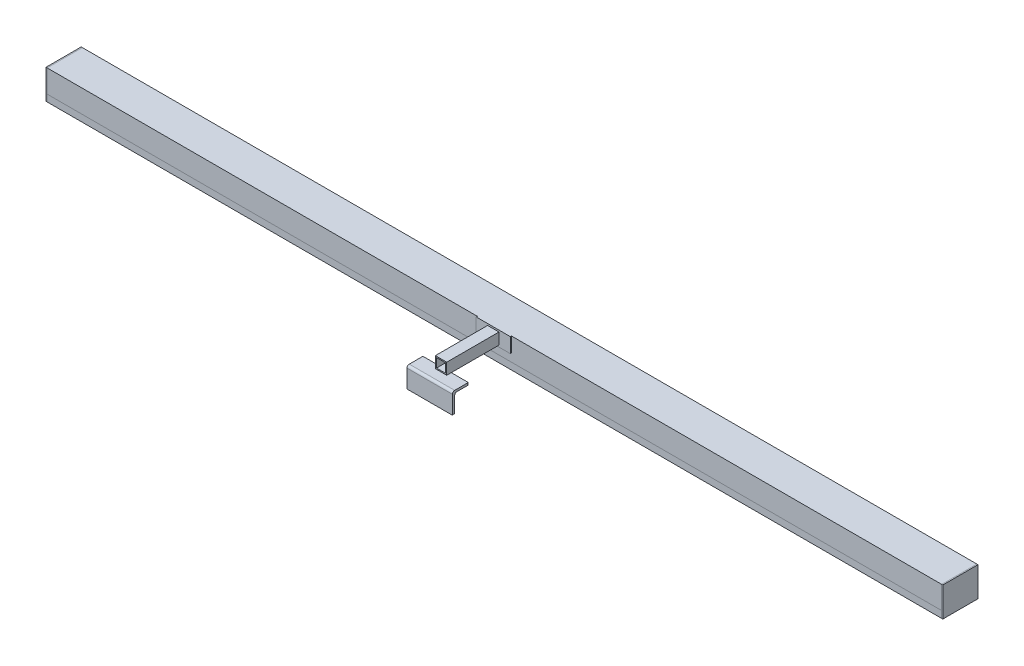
ISO-10303-21;
HEADER;
FILE_DESCRIPTION(('STEP AP214'),'2;1');
FILE_NAME('part.step','',(''),(''),'','','');
FILE_SCHEMA(('AUTOMOTIVE_DESIGN { 1 0 10303 214 1 1 1 1 }'));
ENDSEC;
DATA;
#1=APPLICATION_CONTEXT('core data for automotive mechanical design processes');
#2=APPLICATION_PROTOCOL_DEFINITION('international standard','automotive_design',2000,#1);
#3=PRODUCT_CONTEXT('',#1,'mechanical');
#4=PRODUCT('Part','Part','',(#3));
#5=PRODUCT_RELATED_PRODUCT_CATEGORY('part','',(#4));
#6=PRODUCT_DEFINITION_FORMATION('','',#4);
#7=PRODUCT_DEFINITION_CONTEXT('part definition',#1,'design');
#8=PRODUCT_DEFINITION('design','',#6,#7);
#9=PRODUCT_DEFINITION_SHAPE('','',#8);
#10=(LENGTH_UNIT() NAMED_UNIT(*) SI_UNIT(.MILLI.,.METRE.));
#11=(NAMED_UNIT(*) PLANE_ANGLE_UNIT() SI_UNIT($,.RADIAN.));
#12=(NAMED_UNIT(*) SI_UNIT($,.STERADIAN.) SOLID_ANGLE_UNIT());
#13=UNCERTAINTY_MEASURE_WITH_UNIT(LENGTH_MEASURE(1.E-05),#10,'distance_accuracy_value','');
#14=(GEOMETRIC_REPRESENTATION_CONTEXT(3) GLOBAL_UNCERTAINTY_ASSIGNED_CONTEXT((#13)) GLOBAL_UNIT_ASSIGNED_CONTEXT((#10,
#11,#12)) REPRESENTATION_CONTEXT('',''));
#15=CARTESIAN_POINT('',(0.,0.,0.));
#16=DIRECTION('',(0.,0.,1.));
#17=DIRECTION('',(1.,0.,0.));
#18=AXIS2_PLACEMENT_3D('',#15,#16,#17);
#19=CARTESIAN_POINT('',(395.,20.5,-55.));
#20=DIRECTION('',(0.,0.,-1.));
#21=DIRECTION('',(-1.,0.,0.));
#22=AXIS2_PLACEMENT_3D('',#19,#20,#21);
#23=PLANE('',#22);
#24=DIRECTION('',(0.,-1.,0.));
#25=VECTOR('',#24,1.);
#26=CARTESIAN_POINT('',(394.,20.5,-55.));
#27=LINE('',#26,#25);
#28=CARTESIAN_POINT('',(394.,20.5,-55.));
#29=VERTEX_POINT('',#28);
#30=CARTESIAN_POINT('',(394.,-5.50000000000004,-55.));
#31=VERTEX_POINT('',#30);
#32=EDGE_CURVE('E117',#29,#31,#27,.T.);
#33=ORIENTED_EDGE('',*,*,#32,.T.);
#34=DIRECTION('',(-1.,0.,0.));
#35=VECTOR('',#34,1.);
#36=CARTESIAN_POINT('',(395.,-5.50000000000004,-55.));
#37=LINE('',#36,#35);
#38=CARTESIAN_POINT('',(395.,-5.50000000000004,-55.));
#39=VERTEX_POINT('',#38);
#40=EDGE_CURVE('E12',#39,#31,#37,.T.);
#41=ORIENTED_EDGE('',*,*,#40,.F.);
#42=DIRECTION('',(0.,-1.,0.));
#43=VECTOR('',#42,1.);
#44=CARTESIAN_POINT('',(395.,20.5,-55.));
#45=LINE('',#44,#43);
#46=CARTESIAN_POINT('',(395.,20.5,-55.));
#47=VERTEX_POINT('',#46);
#48=EDGE_CURVE('E105',#47,#39,#45,.T.);
#49=ORIENTED_EDGE('',*,*,#48,.F.);
#50=DIRECTION('',(-1.,0.,0.));
#51=VECTOR('',#50,1.);
#52=CARTESIAN_POINT('',(395.,20.5,-55.));
#53=LINE('',#52,#51);
#54=EDGE_CURVE('E113',#47,#29,#53,.T.);
#55=ORIENTED_EDGE('',*,*,#54,.T.);
#56=EDGE_LOOP('',(#33,#41,#49,#55));
#57=FACE_BOUND('',#56,.T.);
#58=ADVANCED_FACE('F54',(#57),#23,.F.);
#59=CARTESIAN_POINT('',(395.,-5.50000000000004,-55.));
#60=DIRECTION('',(0.,1.,0.));
#61=DIRECTION('',(0.,0.,1.));
#62=AXIS2_PLACEMENT_3D('',#59,#60,#61);
#63=PLANE('',#62);
#64=DIRECTION('',(0.,0.,-1.));
#65=VECTOR('',#64,1.);
#66=CARTESIAN_POINT('',(394.,-5.50000000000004,-55.));
#67=LINE('',#66,#65);
#68=CARTESIAN_POINT('',(394.,-5.50000000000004,-86.));
#69=VERTEX_POINT('',#68);
#70=EDGE_CURVE('E109',#31,#69,#67,.T.);
#71=ORIENTED_EDGE('',*,*,#70,.T.);
#72=DIRECTION('',(-1.,0.,0.));
#73=VECTOR('',#72,1.);
#74=CARTESIAN_POINT('',(395.,-5.50000000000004,-86.));
#75=LINE('',#74,#73);
#76=CARTESIAN_POINT('',(395.,-5.50000000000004,-86.));
#77=VERTEX_POINT('',#76);
#78=EDGE_CURVE('E62',#77,#69,#75,.T.);
#79=ORIENTED_EDGE('',*,*,#78,.F.);
#80=DIRECTION('',(0.,0.,-1.));
#81=VECTOR('',#80,1.);
#82=CARTESIAN_POINT('',(395.,-5.50000000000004,-55.));
#83=LINE('',#82,#81);
#84=EDGE_CURVE('E100',#39,#77,#83,.T.);
#85=ORIENTED_EDGE('',*,*,#84,.F.);
#86=ORIENTED_EDGE('',*,*,#40,.T.);
#87=EDGE_LOOP('',(#71,#79,#85,#86));
#88=FACE_BOUND('',#87,.T.);
#89=ADVANCED_FACE('F108',(#88),#63,.F.);
#90=CARTESIAN_POINT('',(395.,20.5,-86.));
#91=DIRECTION('',(0.,0.,1.));
#92=DIRECTION('',(1.,0.,0.));
#93=AXIS2_PLACEMENT_3D('',#90,#91,#92);
#94=PLANE('',#93);
#95=DIRECTION('',(0.,1.,0.));
#96=VECTOR('',#95,1.);
#97=CARTESIAN_POINT('',(394.,20.5,-86.));
#98=LINE('',#97,#96);
#99=CARTESIAN_POINT('',(394.,20.5,-86.));
#100=VERTEX_POINT('',#99);
#101=EDGE_CURVE('E87',#69,#100,#98,.T.);
#102=ORIENTED_EDGE('',*,*,#101,.T.);
#103=DIRECTION('',(-1.,0.,0.));
#104=VECTOR('',#103,1.);
#105=CARTESIAN_POINT('',(395.,20.5,-86.));
#106=LINE('',#105,#104);
#107=CARTESIAN_POINT('',(395.,20.5,-86.));
#108=VERTEX_POINT('',#107);
#109=EDGE_CURVE('E110',#108,#100,#106,.T.);
#110=ORIENTED_EDGE('',*,*,#109,.F.);
#111=DIRECTION('',(0.,1.,0.));
#112=VECTOR('',#111,1.);
#113=CARTESIAN_POINT('',(395.,20.5,-86.));
#114=LINE('',#113,#112);
#115=EDGE_CURVE('E103',#77,#108,#114,.T.);
#116=ORIENTED_EDGE('',*,*,#115,.F.);
#117=ORIENTED_EDGE('',*,*,#78,.T.);
#118=EDGE_LOOP('',(#102,#110,#116,#117));
#119=FACE_BOUND('',#118,.T.);
#120=ADVANCED_FACE('F111',(#119),#94,.F.);
#121=CARTESIAN_POINT('',(395.,20.5,-55.));
#122=DIRECTION('',(0.,-1.,0.));
#123=DIRECTION('',(0.,0.,-1.));
#124=AXIS2_PLACEMENT_3D('',#121,#122,#123);
#125=PLANE('',#124);
#126=DIRECTION('',(0.,0.,1.));
#127=VECTOR('',#126,1.);
#128=CARTESIAN_POINT('',(394.,20.5,-55.));
#129=LINE('',#128,#127);
#130=EDGE_CURVE('E93',#100,#29,#129,.T.);
#131=ORIENTED_EDGE('',*,*,#130,.T.);
#132=ORIENTED_EDGE('',*,*,#54,.F.);
#133=DIRECTION('',(0.,0.,1.));
#134=VECTOR('',#133,1.);
#135=CARTESIAN_POINT('',(395.,20.5,-55.));
#136=LINE('',#135,#134);
#137=EDGE_CURVE('E70',#108,#47,#136,.T.);
#138=ORIENTED_EDGE('',*,*,#137,.F.);
#139=ORIENTED_EDGE('',*,*,#109,.T.);
#140=EDGE_LOOP('',(#131,#132,#138,#139));
#141=FACE_BOUND('',#140,.T.);
#142=ADVANCED_FACE('F124',(#141),#125,.F.);
#143=CARTESIAN_POINT('',(395.,0.,0.));
#144=DIRECTION('',(1.,0.,0.));
#145=DIRECTION('',(0.,0.,-1.));
#146=AXIS2_PLACEMENT_3D('',#143,#144,#145);
#147=PLANE('',#146);
#148=ORIENTED_EDGE('',*,*,#48,.T.);
#149=ORIENTED_EDGE('',*,*,#84,.T.);
#150=ORIENTED_EDGE('',*,*,#115,.T.);
#151=ORIENTED_EDGE('',*,*,#137,.T.);
#152=EDGE_LOOP('',(#148,#149,#150,#151));
#153=FACE_BOUND('',#152,.T.);
#154=ADVANCED_FACE('F101',(#153),#147,.T.);
#155=CARTESIAN_POINT('',(394.,0.,0.));
#156=DIRECTION('',(1.,0.,0.));
#157=DIRECTION('',(0.,0.,-1.));
#158=AXIS2_PLACEMENT_3D('',#155,#156,#157);
#159=PLANE('',#158);
#160=ORIENTED_EDGE('',*,*,#32,.F.);
#161=ORIENTED_EDGE('',*,*,#130,.F.);
#162=ORIENTED_EDGE('',*,*,#101,.F.);
#163=ORIENTED_EDGE('',*,*,#70,.F.);
#164=EDGE_LOOP('',(#160,#161,#162,#163));
#165=FACE_BOUND('',#164,.T.);
#166=ADVANCED_FACE('F127',(#165),#159,.F.);
#167=CLOSED_SHELL('',(#58,#89,#120,#142,#154,#166));
#168=MANIFOLD_SOLID_BREP('B2',#167);
#169=CARTESIAN_POINT('',(-395.,20.5,-86.));
#170=DIRECTION('',(0.,0.,1.));
#171=DIRECTION('',(1.,0.,0.));
#172=AXIS2_PLACEMENT_3D('',#169,#170,#171);
#173=PLANE('',#172);
#174=DIRECTION('',(0.,-1.,0.));
#175=VECTOR('',#174,1.);
#176=CARTESIAN_POINT('',(-394.,20.5,-86.));
#177=LINE('',#176,#175);
#178=CARTESIAN_POINT('',(-394.,20.5,-86.));
#179=VERTEX_POINT('',#178);
#180=CARTESIAN_POINT('',(-394.,-5.50000000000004,-86.));
#181=VERTEX_POINT('',#180);
#182=EDGE_CURVE('E251',#179,#181,#177,.T.);
#183=ORIENTED_EDGE('',*,*,#182,.T.);
#184=DIRECTION('',(1.,0.,0.));
#185=VECTOR('',#184,1.);
#186=CARTESIAN_POINT('',(-395.,-5.50000000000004,-86.));
#187=LINE('',#186,#185);
#188=CARTESIAN_POINT('',(-395.,-5.50000000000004,-86.));
#189=VERTEX_POINT('',#188);
#190=EDGE_CURVE('E52',#189,#181,#187,.T.);
#191=ORIENTED_EDGE('',*,*,#190,.F.);
#192=DIRECTION('',(0.,-1.,0.));
#193=VECTOR('',#192,1.);
#194=CARTESIAN_POINT('',(-395.,20.5,-86.));
#195=LINE('',#194,#193);
#196=CARTESIAN_POINT('',(-395.,20.5,-86.));
#197=VERTEX_POINT('',#196);
#198=EDGE_CURVE('E239',#197,#189,#195,.T.);
#199=ORIENTED_EDGE('',*,*,#198,.F.);
#200=DIRECTION('',(1.,0.,0.));
#201=VECTOR('',#200,1.);
#202=CARTESIAN_POINT('',(-395.,20.5,-86.));
#203=LINE('',#202,#201);
#204=EDGE_CURVE('E247',#197,#179,#203,.T.);
#205=ORIENTED_EDGE('',*,*,#204,.T.);
#206=EDGE_LOOP('',(#183,#191,#199,#205));
#207=FACE_BOUND('',#206,.T.);
#208=ADVANCED_FACE('F188',(#207),#173,.F.);
#209=CARTESIAN_POINT('',(-395.,-5.50000000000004,-86.));
#210=DIRECTION('',(0.,1.,0.));
#211=DIRECTION('',(0.,0.,1.));
#212=AXIS2_PLACEMENT_3D('',#209,#210,#211);
#213=PLANE('',#212);
#214=DIRECTION('',(0.,0.,1.));
#215=VECTOR('',#214,1.);
#216=CARTESIAN_POINT('',(-394.,-5.50000000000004,-86.));
#217=LINE('',#216,#215);
#218=CARTESIAN_POINT('',(-394.,-5.50000000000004,-55.));
#219=VERTEX_POINT('',#218);
#220=EDGE_CURVE('E243',#181,#219,#217,.T.);
#221=ORIENTED_EDGE('',*,*,#220,.T.);
#222=DIRECTION('',(1.,0.,0.));
#223=VECTOR('',#222,1.);
#224=CARTESIAN_POINT('',(-395.,-5.50000000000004,-55.));
#225=LINE('',#224,#223);
#226=CARTESIAN_POINT('',(-395.,-5.50000000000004,-55.));
#227=VERTEX_POINT('',#226);
#228=EDGE_CURVE('E196',#227,#219,#225,.T.);
#229=ORIENTED_EDGE('',*,*,#228,.F.);
#230=DIRECTION('',(0.,0.,1.));
#231=VECTOR('',#230,1.);
#232=CARTESIAN_POINT('',(-395.,-5.50000000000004,-86.));
#233=LINE('',#232,#231);
#234=EDGE_CURVE('E234',#189,#227,#233,.T.);
#235=ORIENTED_EDGE('',*,*,#234,.F.);
#236=ORIENTED_EDGE('',*,*,#190,.T.);
#237=EDGE_LOOP('',(#221,#229,#235,#236));
#238=FACE_BOUND('',#237,.T.);
#239=ADVANCED_FACE('F242',(#238),#213,.F.);
#240=CARTESIAN_POINT('',(-395.,20.5,-55.));
#241=DIRECTION('',(0.,0.,-1.));
#242=DIRECTION('',(-1.,0.,0.));
#243=AXIS2_PLACEMENT_3D('',#240,#241,#242);
#244=PLANE('',#243);
#245=DIRECTION('',(0.,1.,0.));
#246=VECTOR('',#245,1.);
#247=CARTESIAN_POINT('',(-394.,20.5,-55.));
#248=LINE('',#247,#246);
#249=CARTESIAN_POINT('',(-394.,20.5,-55.));
#250=VERTEX_POINT('',#249);
#251=EDGE_CURVE('E221',#219,#250,#248,.T.);
#252=ORIENTED_EDGE('',*,*,#251,.T.);
#253=DIRECTION('',(1.,0.,0.));
#254=VECTOR('',#253,1.);
#255=CARTESIAN_POINT('',(-395.,20.5,-55.));
#256=LINE('',#255,#254);
#257=CARTESIAN_POINT('',(-395.,20.5,-55.));
#258=VERTEX_POINT('',#257);
#259=EDGE_CURVE('E244',#258,#250,#256,.T.);
#260=ORIENTED_EDGE('',*,*,#259,.F.);
#261=DIRECTION('',(0.,1.,0.));
#262=VECTOR('',#261,1.);
#263=CARTESIAN_POINT('',(-395.,20.5,-55.));
#264=LINE('',#263,#262);
#265=EDGE_CURVE('E237',#227,#258,#264,.T.);
#266=ORIENTED_EDGE('',*,*,#265,.F.);
#267=ORIENTED_EDGE('',*,*,#228,.T.);
#268=EDGE_LOOP('',(#252,#260,#266,#267));
#269=FACE_BOUND('',#268,.T.);
#270=ADVANCED_FACE('F245',(#269),#244,.F.);
#271=CARTESIAN_POINT('',(-395.,20.5,-86.));
#272=DIRECTION('',(0.,-1.,0.));
#273=DIRECTION('',(0.,0.,-1.));
#274=AXIS2_PLACEMENT_3D('',#271,#272,#273);
#275=PLANE('',#274);
#276=DIRECTION('',(0.,0.,-1.));
#277=VECTOR('',#276,1.);
#278=CARTESIAN_POINT('',(-394.,20.5,-86.));
#279=LINE('',#278,#277);
#280=EDGE_CURVE('E227',#250,#179,#279,.T.);
#281=ORIENTED_EDGE('',*,*,#280,.T.);
#282=ORIENTED_EDGE('',*,*,#204,.F.);
#283=DIRECTION('',(0.,0.,-1.));
#284=VECTOR('',#283,1.);
#285=CARTESIAN_POINT('',(-395.,20.5,-86.));
#286=LINE('',#285,#284);
#287=EDGE_CURVE('E204',#258,#197,#286,.T.);
#288=ORIENTED_EDGE('',*,*,#287,.F.);
#289=ORIENTED_EDGE('',*,*,#259,.T.);
#290=EDGE_LOOP('',(#281,#282,#288,#289));
#291=FACE_BOUND('',#290,.T.);
#292=ADVANCED_FACE('F258',(#291),#275,.F.);
#293=CARTESIAN_POINT('',(-395.,0.,0.));
#294=DIRECTION('',(-1.,0.,0.));
#295=DIRECTION('',(0.,0.,1.));
#296=AXIS2_PLACEMENT_3D('',#293,#294,#295);
#297=PLANE('',#296);
#298=ORIENTED_EDGE('',*,*,#198,.T.);
#299=ORIENTED_EDGE('',*,*,#234,.T.);
#300=ORIENTED_EDGE('',*,*,#265,.T.);
#301=ORIENTED_EDGE('',*,*,#287,.T.);
#302=EDGE_LOOP('',(#298,#299,#300,#301));
#303=FACE_BOUND('',#302,.T.);
#304=ADVANCED_FACE('F235',(#303),#297,.T.);
#305=CARTESIAN_POINT('',(-394.,0.,0.));
#306=DIRECTION('',(-1.,0.,0.));
#307=DIRECTION('',(0.,0.,1.));
#308=AXIS2_PLACEMENT_3D('',#305,#306,#307);
#309=PLANE('',#308);
#310=ORIENTED_EDGE('',*,*,#182,.F.);
#311=ORIENTED_EDGE('',*,*,#280,.F.);
#312=ORIENTED_EDGE('',*,*,#251,.F.);
#313=ORIENTED_EDGE('',*,*,#220,.F.);
#314=EDGE_LOOP('',(#310,#311,#312,#313));
#315=FACE_BOUND('',#314,.T.);
#316=ADVANCED_FACE('F261',(#315),#309,.F.);
#317=CLOSED_SHELL('',(#208,#239,#270,#292,#304,#316));
#318=MANIFOLD_SOLID_BREP('B6',#317);
#319=CARTESIAN_POINT('',(-394.,-5.50000000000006,-55.));
#320=DIRECTION('',(1.,0.,0.));
#321=DIRECTION('',(0.,0.,-1.));
#322=AXIS2_PLACEMENT_3D('',#319,#320,#321);
#323=PLANE('',#322);
#324=DIRECTION('',(0.,0.,-1.));
#325=VECTOR('',#324,1.);
#326=CARTESIAN_POINT('',(-394.,0.499999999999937,-55.));
#327=LINE('',#326,#325);
#328=CARTESIAN_POINT('',(-394.,0.499999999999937,-55.));
#329=VERTEX_POINT('',#328);
#330=CARTESIAN_POINT('',(-394.,0.499999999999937,-86.));
#331=VERTEX_POINT('',#330);
#332=EDGE_CURVE('E384',#329,#331,#327,.T.);
#333=ORIENTED_EDGE('',*,*,#332,.T.);
#334=DIRECTION('',(0.,1.,0.));
#335=VECTOR('',#334,1.);
#336=CARTESIAN_POINT('',(-394.,-5.50000000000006,-86.));
#337=LINE('',#336,#335);
#338=CARTESIAN_POINT('',(-394.,-5.50000000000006,-86.));
#339=VERTEX_POINT('',#338);
#340=EDGE_CURVE('E186',#339,#331,#337,.T.);
#341=ORIENTED_EDGE('',*,*,#340,.F.);
#342=DIRECTION('',(0.,0.,-1.));
#343=VECTOR('',#342,1.);
#344=CARTESIAN_POINT('',(-394.,-5.50000000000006,-55.));
#345=LINE('',#344,#343);
#346=CARTESIAN_POINT('',(-394.,-5.50000000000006,-55.));
#347=VERTEX_POINT('',#346);
#348=EDGE_CURVE('E372',#347,#339,#345,.T.);
#349=ORIENTED_EDGE('',*,*,#348,.F.);
#350=DIRECTION('',(0.,1.,0.));
#351=VECTOR('',#350,1.);
#352=CARTESIAN_POINT('',(-394.,-5.50000000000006,-55.));
#353=LINE('',#352,#351);
#354=EDGE_CURVE('E380',#347,#329,#353,.T.);
#355=ORIENTED_EDGE('',*,*,#354,.T.);
#356=EDGE_LOOP('',(#333,#341,#349,#355));
#357=FACE_BOUND('',#356,.T.);
#358=ADVANCED_FACE('F321',(#357),#323,.F.);
#359=CARTESIAN_POINT('',(-394.,-5.50000000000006,-86.));
#360=DIRECTION('',(0.,0.,1.));
#361=DIRECTION('',(1.,0.,0.));
#362=AXIS2_PLACEMENT_3D('',#359,#360,#361);
#363=PLANE('',#362);
#364=DIRECTION('',(1.,0.,0.));
#365=VECTOR('',#364,1.);
#366=CARTESIAN_POINT('',(-394.,0.499999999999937,-86.));
#367=LINE('',#366,#365);
#368=CARTESIAN_POINT('',(394.,0.499999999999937,-86.));
#369=VERTEX_POINT('',#368);
#370=EDGE_CURVE('E376',#331,#369,#367,.T.);
#371=ORIENTED_EDGE('',*,*,#370,.T.);
#372=DIRECTION('',(0.,1.,0.));
#373=VECTOR('',#372,1.);
#374=CARTESIAN_POINT('',(394.,-5.50000000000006,-86.));
#375=LINE('',#374,#373);
#376=CARTESIAN_POINT('',(394.,-5.50000000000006,-86.));
#377=VERTEX_POINT('',#376);
#378=EDGE_CURVE('E329',#377,#369,#375,.T.);
#379=ORIENTED_EDGE('',*,*,#378,.F.);
#380=DIRECTION('',(1.,0.,0.));
#381=VECTOR('',#380,1.);
#382=CARTESIAN_POINT('',(-394.,-5.50000000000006,-86.));
#383=LINE('',#382,#381);
#384=EDGE_CURVE('E367',#339,#377,#383,.T.);
#385=ORIENTED_EDGE('',*,*,#384,.F.);
#386=ORIENTED_EDGE('',*,*,#340,.T.);
#387=EDGE_LOOP('',(#371,#379,#385,#386));
#388=FACE_BOUND('',#387,.T.);
#389=ADVANCED_FACE('F375',(#388),#363,.F.);
#390=CARTESIAN_POINT('',(394.,-5.50000000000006,-55.));
#391=DIRECTION('',(-1.,0.,0.));
#392=DIRECTION('',(0.,0.,1.));
#393=AXIS2_PLACEMENT_3D('',#390,#391,#392);
#394=PLANE('',#393);
#395=DIRECTION('',(0.,0.,1.));
#396=VECTOR('',#395,1.);
#397=CARTESIAN_POINT('',(394.,0.499999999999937,-55.));
#398=LINE('',#397,#396);
#399=CARTESIAN_POINT('',(394.,0.499999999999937,-55.));
#400=VERTEX_POINT('',#399);
#401=EDGE_CURVE('E354',#369,#400,#398,.T.);
#402=ORIENTED_EDGE('',*,*,#401,.T.);
#403=DIRECTION('',(0.,1.,0.));
#404=VECTOR('',#403,1.);
#405=CARTESIAN_POINT('',(394.,-5.50000000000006,-55.));
#406=LINE('',#405,#404);
#407=CARTESIAN_POINT('',(394.,-5.50000000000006,-55.));
#408=VERTEX_POINT('',#407);
#409=EDGE_CURVE('E377',#408,#400,#406,.T.);
#410=ORIENTED_EDGE('',*,*,#409,.F.);
#411=DIRECTION('',(0.,0.,1.));
#412=VECTOR('',#411,1.);
#413=CARTESIAN_POINT('',(394.,-5.50000000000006,-55.));
#414=LINE('',#413,#412);
#415=EDGE_CURVE('E370',#377,#408,#414,.T.);
#416=ORIENTED_EDGE('',*,*,#415,.F.);
#417=ORIENTED_EDGE('',*,*,#378,.T.);
#418=EDGE_LOOP('',(#402,#410,#416,#417));
#419=FACE_BOUND('',#418,.T.);
#420=ADVANCED_FACE('F378',(#419),#394,.F.);
#421=CARTESIAN_POINT('',(-394.,-5.50000000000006,-55.));
#422=DIRECTION('',(0.,0.,-1.));
#423=DIRECTION('',(-1.,0.,0.));
#424=AXIS2_PLACEMENT_3D('',#421,#422,#423);
#425=PLANE('',#424);
#426=DIRECTION('',(-1.,0.,0.));
#427=VECTOR('',#426,1.);
#428=CARTESIAN_POINT('',(-394.,0.499999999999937,-55.));
#429=LINE('',#428,#427);
#430=EDGE_CURVE('E360',#400,#329,#429,.T.);
#431=ORIENTED_EDGE('',*,*,#430,.T.);
#432=ORIENTED_EDGE('',*,*,#354,.F.);
#433=DIRECTION('',(-1.,0.,0.));
#434=VECTOR('',#433,1.);
#435=CARTESIAN_POINT('',(-394.,-5.50000000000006,-55.));
#436=LINE('',#435,#434);
#437=EDGE_CURVE('E337',#408,#347,#436,.T.);
#438=ORIENTED_EDGE('',*,*,#437,.F.);
#439=ORIENTED_EDGE('',*,*,#409,.T.);
#440=EDGE_LOOP('',(#431,#432,#438,#439));
#441=FACE_BOUND('',#440,.T.);
#442=ADVANCED_FACE('F391',(#441),#425,.F.);
#443=CARTESIAN_POINT('',(0.,-5.50000000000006,0.));
#444=DIRECTION('',(0.,-1.,0.));
#445=DIRECTION('',(0.,0.,-1.));
#446=AXIS2_PLACEMENT_3D('',#443,#444,#445);
#447=PLANE('',#446);
#448=ORIENTED_EDGE('',*,*,#348,.T.);
#449=ORIENTED_EDGE('',*,*,#384,.T.);
#450=ORIENTED_EDGE('',*,*,#415,.T.);
#451=ORIENTED_EDGE('',*,*,#437,.T.);
#452=EDGE_LOOP('',(#448,#449,#450,#451));
#453=FACE_BOUND('',#452,.T.);
#454=ADVANCED_FACE('F368',(#453),#447,.T.);
#455=CARTESIAN_POINT('',(0.,0.499999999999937,0.));
#456=DIRECTION('',(0.,-1.,0.));
#457=DIRECTION('',(0.,0.,-1.));
#458=AXIS2_PLACEMENT_3D('',#455,#456,#457);
#459=PLANE('',#458);
#460=ORIENTED_EDGE('',*,*,#332,.F.);
#461=ORIENTED_EDGE('',*,*,#430,.F.);
#462=ORIENTED_EDGE('',*,*,#401,.F.);
#463=ORIENTED_EDGE('',*,*,#370,.F.);
#464=EDGE_LOOP('',(#460,#461,#462,#463));
#465=FACE_BOUND('',#464,.T.);
#466=ADVANCED_FACE('F394',(#465),#459,.F.);
#467=CLOSED_SHELL('',(#358,#389,#420,#442,#454,#466));
#468=MANIFOLD_SOLID_BREP('B46',#467);
#469=CARTESIAN_POINT('',(-20.,9.,2.));
#470=DIRECTION('',(0.,-1.,0.));
#471=DIRECTION('',(0.,0.,-1.));
#472=AXIS2_PLACEMENT_3D('',#469,#470,#471);
#473=PLANE('',#472);
#474=DIRECTION('',(0.,0.,1.));
#475=VECTOR('',#474,1.);
#476=CARTESIAN_POINT('',(-5.,9.,-54.));
#477=LINE('',#476,#475);
#478=CARTESIAN_POINT('',(-5.,9.,-12.));
#479=VERTEX_POINT('',#478);
#480=CARTESIAN_POINT('',(-5.,9.,-8.));
#481=VERTEX_POINT('',#480);
#482=EDGE_CURVE('E777',#479,#481,#477,.T.);
#483=ORIENTED_EDGE('',*,*,#482,.F.);
#484=DIRECTION('',(-1.,0.,0.));
#485=VECTOR('',#484,1.);
#486=CARTESIAN_POINT('',(0.,9.,-12.));
#487=LINE('',#486,#485);
#488=CARTESIAN_POINT('',(-19.5,9.,-12.));
#489=VERTEX_POINT('',#488);
#490=EDGE_CURVE('E776',#479,#489,#487,.T.);
#491=ORIENTED_EDGE('',*,*,#490,.T.);
#492=CARTESIAN_POINT('',(-19.5,9.,-11.5));
#493=DIRECTION('',(0.,-1.,0.));
#494=DIRECTION('',(0.,0.,-1.));
#495=AXIS2_PLACEMENT_3D('',#492,#493,#494);
#496=CIRCLE('',#495,0.5);
#497=CARTESIAN_POINT('',(-20.,9.,-11.5));
#498=VERTEX_POINT('',#497);
#499=EDGE_CURVE('E908',#489,#498,#496,.F.);
#500=ORIENTED_EDGE('',*,*,#499,.T.);
#501=DIRECTION('',(0.,0.,-1.));
#502=VECTOR('',#501,1.);
#503=CARTESIAN_POINT('',(-20.,9.,2.));
#504=LINE('',#503,#502);
#505=CARTESIAN_POINT('',(-20.,9.,0.));
#506=VERTEX_POINT('',#505);
#507=EDGE_CURVE('E827',#506,#498,#504,.T.);
#508=ORIENTED_EDGE('',*,*,#507,.F.);
#509=DIRECTION('',(-1.,0.,0.));
#510=VECTOR('',#509,1.);
#511=CARTESIAN_POINT('',(-20.,9.,0.));
#512=LINE('',#511,#510);
#513=CARTESIAN_POINT('',(20.,9.,0.));
#514=VERTEX_POINT('',#513);
#515=EDGE_CURVE('E864',#506,#514,#512,.F.);
#516=ORIENTED_EDGE('',*,*,#515,.T.);
#517=DIRECTION('',(0.,0.,-1.));
#518=VECTOR('',#517,1.);
#519=CARTESIAN_POINT('',(20.,9.,2.));
#520=LINE('',#519,#518);
#521=CARTESIAN_POINT('',(20.,9.,-11.5));
#522=VERTEX_POINT('',#521);
#523=EDGE_CURVE('E839',#514,#522,#520,.T.);
#524=ORIENTED_EDGE('',*,*,#523,.T.);
#525=CARTESIAN_POINT('',(19.5,9.,-11.5));
#526=DIRECTION('',(0.,-1.,0.));
#527=DIRECTION('',(0.,0.,-1.));
#528=AXIS2_PLACEMENT_3D('',#525,#526,#527);
#529=CIRCLE('',#528,0.5);
#530=CARTESIAN_POINT('',(19.5,9.,-12.));
#531=VERTEX_POINT('',#530);
#532=EDGE_CURVE('E454',#522,#531,#529,.F.);
#533=ORIENTED_EDGE('',*,*,#532,.T.);
#534=CARTESIAN_POINT('',(5.,9.,-12.));
#535=VERTEX_POINT('',#534);
#536=EDGE_CURVE('E805',#531,#535,#487,.T.);
#537=ORIENTED_EDGE('',*,*,#536,.T.);
#538=DIRECTION('',(0.,0.,1.));
#539=VECTOR('',#538,1.);
#540=CARTESIAN_POINT('',(5.,9.,-54.));
#541=LINE('',#540,#539);
#542=CARTESIAN_POINT('',(5.,9.,-8.));
#543=VERTEX_POINT('',#542);
#544=EDGE_CURVE('E466',#535,#543,#541,.T.);
#545=ORIENTED_EDGE('',*,*,#544,.T.);
#546=DIRECTION('',(1.,0.,0.));
#547=VECTOR('',#546,1.);
#548=CARTESIAN_POINT('',(0.,9.,-8.));
#549=LINE('',#548,#547);
#550=EDGE_CURVE('E461',#481,#543,#549,.T.);
#551=ORIENTED_EDGE('',*,*,#550,.F.);
#552=EDGE_LOOP('',(#483,#491,#500,#508,#516,#524,#533,#537,#545,#551));
#553=FACE_BOUND('',#552,.T.);
#554=ADVANCED_FACE('F445',(#553),#473,.F.);
#555=CARTESIAN_POINT('',(19.5,7.,-11.5));
#556=DIRECTION('',(0.,1.,0.));
#557=DIRECTION('',(0.,0.,1.));
#558=AXIS2_PLACEMENT_3D('',#555,#556,#557);
#559=CYLINDRICAL_SURFACE('',#558,0.5);
#560=DIRECTION('',(0.,-1.,0.));
#561=VECTOR('',#560,1.);
#562=CARTESIAN_POINT('',(19.5,7.,-12.));
#563=LINE('',#562,#561);
#564=CARTESIAN_POINT('',(19.5,7.,-12.));
#565=VERTEX_POINT('',#564);
#566=EDGE_CURVE('E915',#531,#565,#563,.T.);
#567=ORIENTED_EDGE('',*,*,#566,.F.);
#568=ORIENTED_EDGE('',*,*,#532,.F.);
#569=DIRECTION('',(0.,-1.,0.));
#570=VECTOR('',#569,1.);
#571=CARTESIAN_POINT('',(20.,7.,-11.5));
#572=LINE('',#571,#570);
#573=CARTESIAN_POINT('',(20.,7.,-11.5));
#574=VERTEX_POINT('',#573);
#575=EDGE_CURVE('E919',#574,#522,#572,.F.);
#576=ORIENTED_EDGE('',*,*,#575,.F.);
#577=CARTESIAN_POINT('',(19.5,7.,-11.5));
#578=DIRECTION('',(0.,1.,0.));
#579=DIRECTION('',(0.,0.,1.));
#580=AXIS2_PLACEMENT_3D('',#577,#578,#579);
#581=CIRCLE('',#580,0.5);
#582=EDGE_CURVE('E319',#565,#574,#581,.F.);
#583=ORIENTED_EDGE('',*,*,#582,.F.);
#584=EDGE_LOOP('',(#567,#568,#576,#583));
#585=FACE_BOUND('',#584,.T.);
#586=ADVANCED_FACE('F447',(#585),#559,.T.);
#587=CARTESIAN_POINT('',(-19.5,-9.,-11.5));
#588=DIRECTION('',(0.,1.,0.));
#589=DIRECTION('',(0.,0.,1.));
#590=AXIS2_PLACEMENT_3D('',#587,#588,#589);
#591=CYLINDRICAL_SURFACE('',#590,0.5);
#592=DIRECTION('',(0.,-1.,0.));
#593=VECTOR('',#592,1.);
#594=CARTESIAN_POINT('',(-20.,-9.,-11.5));
#595=LINE('',#594,#593);
#596=CARTESIAN_POINT('',(-20.,7.,-11.5));
#597=VERTEX_POINT('',#596);
#598=EDGE_CURVE('E900',#498,#597,#595,.T.);
#599=ORIENTED_EDGE('',*,*,#598,.F.);
#600=ORIENTED_EDGE('',*,*,#499,.F.);
#601=DIRECTION('',(0.,-1.,0.));
#602=VECTOR('',#601,1.);
#603=CARTESIAN_POINT('',(-19.5,-9.,-12.));
#604=LINE('',#603,#602);
#605=CARTESIAN_POINT('',(-19.5,7.,-12.));
#606=VERTEX_POINT('',#605);
#607=EDGE_CURVE('E904',#606,#489,#604,.F.);
#608=ORIENTED_EDGE('',*,*,#607,.F.);
#609=CARTESIAN_POINT('',(-19.5,7.,-11.5));
#610=DIRECTION('',(0.,1.,0.));
#611=DIRECTION('',(0.,0.,1.));
#612=AXIS2_PLACEMENT_3D('',#609,#610,#611);
#613=CIRCLE('',#612,0.5);
#614=EDGE_CURVE('E911',#597,#606,#613,.F.);
#615=ORIENTED_EDGE('',*,*,#614,.F.);
#616=EDGE_LOOP('',(#599,#600,#608,#615));
#617=FACE_BOUND('',#616,.T.);
#618=ADVANCED_FACE('F941',(#617),#591,.T.);
#619=CARTESIAN_POINT('',(-19.5,-8.5,2.));
#620=DIRECTION('',(0.,0.,-1.));
#621=DIRECTION('',(-1.,0.,0.));
#622=AXIS2_PLACEMENT_3D('',#619,#620,#621);
#623=CYLINDRICAL_SURFACE('',#622,0.5);
#624=DIRECTION('',(0.,0.,-1.));
#625=VECTOR('',#624,1.);
#626=CARTESIAN_POINT('',(-19.5,-9.,2.));
#627=LINE('',#626,#625);
#628=CARTESIAN_POINT('',(-19.5,-9.,2.));
#629=VERTEX_POINT('',#628);
#630=CARTESIAN_POINT('',(-19.5,-9.,0.));
#631=VERTEX_POINT('',#630);
#632=EDGE_CURVE('E886',#629,#631,#627,.T.);
#633=ORIENTED_EDGE('',*,*,#632,.F.);
#634=CARTESIAN_POINT('',(-19.5,-8.5,2.));
#635=DIRECTION('',(0.,0.,-1.));
#636=DIRECTION('',(-1.,0.,0.));
#637=AXIS2_PLACEMENT_3D('',#634,#635,#636);
#638=CIRCLE('',#637,0.5);
#639=CARTESIAN_POINT('',(-20.,-8.5,2.));
#640=VERTEX_POINT('',#639);
#641=EDGE_CURVE('E894',#640,#629,#638,.F.);
#642=ORIENTED_EDGE('',*,*,#641,.F.);
#643=DIRECTION('',(0.,0.,-1.));
#644=VECTOR('',#643,1.);
#645=CARTESIAN_POINT('',(-20.,-8.5,2.));
#646=LINE('',#645,#644);
#647=CARTESIAN_POINT('',(-20.,-8.5,0.));
#648=VERTEX_POINT('',#647);
#649=EDGE_CURVE('E890',#648,#640,#646,.F.);
#650=ORIENTED_EDGE('',*,*,#649,.F.);
#651=CARTESIAN_POINT('',(-19.5,-8.5,0.));
#652=DIRECTION('',(0.,0.,-1.));
#653=DIRECTION('',(-1.,0.,0.));
#654=AXIS2_PLACEMENT_3D('',#651,#652,#653);
#655=CIRCLE('',#654,0.5);
#656=EDGE_CURVE('E897',#631,#648,#655,.T.);
#657=ORIENTED_EDGE('',*,*,#656,.F.);
#658=EDGE_LOOP('',(#633,#642,#650,#657));
#659=FACE_BOUND('',#658,.T.);
#660=ADVANCED_FACE('F971',(#659),#623,.T.);
#661=CARTESIAN_POINT('',(19.6464466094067,-8.64644660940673,0.));
#662=DIRECTION('',(0.,0.,1.));
#663=DIRECTION('',(1.,0.,0.));
#664=AXIS2_PLACEMENT_3D('',#661,#662,#663);
#665=CYLINDRICAL_SURFACE('',#664,0.353553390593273);
#666=DIRECTION('',(0.,0.,1.));
#667=VECTOR('',#666,1.);
#668=CARTESIAN_POINT('',(19.6464466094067,-9.,2.));
#669=LINE('',#668,#667);
#670=CARTESIAN_POINT('',(19.6464466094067,-9.,0.));
#671=VERTEX_POINT('',#670);
#672=CARTESIAN_POINT('',(19.6464466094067,-9.,2.));
#673=VERTEX_POINT('',#672);
#674=EDGE_CURVE('E871',#671,#673,#669,.T.);
#675=ORIENTED_EDGE('',*,*,#674,.F.);
#676=CARTESIAN_POINT('',(19.6464466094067,-8.64644660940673,0.));
#677=DIRECTION('',(0.,0.,-1.));
#678=DIRECTION('',(-1.,0.,0.));
#679=AXIS2_PLACEMENT_3D('',#676,#677,#678);
#680=CIRCLE('',#679,0.353553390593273);
#681=CARTESIAN_POINT('',(20.,-8.64644660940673,0.));
#682=VERTEX_POINT('',#681);
#683=EDGE_CURVE('E879',#682,#671,#680,.T.);
#684=ORIENTED_EDGE('',*,*,#683,.F.);
#685=DIRECTION('',(0.,0.,1.));
#686=VECTOR('',#685,1.);
#687=CARTESIAN_POINT('',(20.,-8.64644660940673,2.));
#688=LINE('',#687,#686);
#689=CARTESIAN_POINT('',(20.,-8.64644660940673,2.));
#690=VERTEX_POINT('',#689);
#691=EDGE_CURVE('E875',#690,#682,#688,.F.);
#692=ORIENTED_EDGE('',*,*,#691,.F.);
#693=CARTESIAN_POINT('',(19.6464466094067,-8.64644660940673,2.));
#694=DIRECTION('',(0.,0.,-1.));
#695=DIRECTION('',(-1.,0.,0.));
#696=AXIS2_PLACEMENT_3D('',#693,#694,#695);
#697=CIRCLE('',#696,0.353553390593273);
#698=EDGE_CURVE('E883',#673,#690,#697,.F.);
#699=ORIENTED_EDGE('',*,*,#698,.F.);
#700=EDGE_LOOP('',(#675,#684,#692,#699));
#701=FACE_BOUND('',#700,.T.);
#702=ADVANCED_FACE('F979',(#701),#665,.T.);
#703=CARTESIAN_POINT('',(0.,0.,0.));
#704=DIRECTION('',(0.,0.,-1.));
#705=DIRECTION('',(-1.,0.,0.));
#706=AXIS2_PLACEMENT_3D('',#703,#704,#705);
#707=PLANE('',#706);
#708=DIRECTION('',(1.,0.,0.));
#709=VECTOR('',#708,1.);
#710=CARTESIAN_POINT('',(-20.,-9.,0.));
#711=LINE('',#710,#709);
#712=EDGE_CURVE('E831',#631,#671,#711,.T.);
#713=ORIENTED_EDGE('',*,*,#712,.F.);
#714=ORIENTED_EDGE('',*,*,#656,.T.);
#715=DIRECTION('',(0.,-1.,0.));
#716=VECTOR('',#715,1.);
#717=CARTESIAN_POINT('',(-20.,-9.,0.));
#718=LINE('',#717,#716);
#719=CARTESIAN_POINT('',(-20.,5.,0.));
#720=VERTEX_POINT('',#719);
#721=EDGE_CURVE('E812',#720,#648,#718,.T.);
#722=ORIENTED_EDGE('',*,*,#721,.F.);
#723=DIRECTION('',(1.,0.,0.));
#724=VECTOR('',#723,1.);
#725=CARTESIAN_POINT('',(0.,5.,0.));
#726=LINE('',#725,#724);
#727=CARTESIAN_POINT('',(20.,5.,0.));
#728=VERTEX_POINT('',#727);
#729=EDGE_CURVE('E843',#720,#728,#726,.T.);
#730=ORIENTED_EDGE('',*,*,#729,.T.);
#731=DIRECTION('',(0.,1.,0.));
#732=VECTOR('',#731,1.);
#733=CARTESIAN_POINT('',(20.,-9.,0.));
#734=LINE('',#733,#732);
#735=EDGE_CURVE('E821',#682,#728,#734,.T.);
#736=ORIENTED_EDGE('',*,*,#735,.F.);
#737=ORIENTED_EDGE('',*,*,#683,.T.);
#738=EDGE_LOOP('',(#713,#714,#722,#730,#736,#737));
#739=FACE_BOUND('',#738,.T.);
#740=ADVANCED_FACE('F966',(#739),#707,.T.);
#741=CARTESIAN_POINT('',(-20.,-9.,2.));
#742=DIRECTION('',(1.,0.,0.));
#743=DIRECTION('',(0.,0.,-1.));
#744=AXIS2_PLACEMENT_3D('',#741,#742,#743);
#745=PLANE('',#744);
#746=ORIENTED_EDGE('',*,*,#507,.T.);
#747=ORIENTED_EDGE('',*,*,#598,.T.);
#748=DIRECTION('',(0.,0.,1.));
#749=VECTOR('',#748,1.);
#750=CARTESIAN_POINT('',(-20.,7.,-12.));
#751=LINE('',#750,#749);
#752=CARTESIAN_POINT('',(-20.,7.,-2.));
#753=VERTEX_POINT('',#752);
#754=EDGE_CURVE('E804',#597,#753,#751,.T.);
#755=ORIENTED_EDGE('',*,*,#754,.T.);
#756=CARTESIAN_POINT('',(-20.,5.,-2.));
#757=DIRECTION('',(1.,0.,0.));
#758=DIRECTION('',(0.,0.,-1.));
#759=AXIS2_PLACEMENT_3D('',#756,#757,#758);
#760=CIRCLE('',#759,2.);
#761=EDGE_CURVE('E854',#753,#720,#760,.T.);
#762=ORIENTED_EDGE('',*,*,#761,.T.);
#763=ORIENTED_EDGE('',*,*,#721,.T.);
#764=ORIENTED_EDGE('',*,*,#649,.T.);
#765=DIRECTION('',(0.,-1.,0.));
#766=VECTOR('',#765,1.);
#767=CARTESIAN_POINT('',(-20.,-9.,2.));
#768=LINE('',#767,#766);
#769=CARTESIAN_POINT('',(-20.,7.,2.));
#770=VERTEX_POINT('',#769);
#771=EDGE_CURVE('E816',#770,#640,#768,.T.);
#772=ORIENTED_EDGE('',*,*,#771,.F.);
#773=CARTESIAN_POINT('',(-20.,7.,0.));
#774=DIRECTION('',(1.,0.,0.));
#775=DIRECTION('',(0.,0.,-1.));
#776=AXIS2_PLACEMENT_3D('',#773,#774,#775);
#777=CIRCLE('',#776,2.);
#778=EDGE_CURVE('E861',#770,#506,#777,.F.);
#779=ORIENTED_EDGE('',*,*,#778,.T.);
#780=EDGE_LOOP('',(#746,#747,#755,#762,#763,#764,#772,#779));
#781=FACE_BOUND('',#780,.T.);
#782=ADVANCED_FACE('F946',(#781),#745,.F.);
#783=CARTESIAN_POINT('',(-20.,-9.,2.));
#784=DIRECTION('',(0.,1.,0.));
#785=DIRECTION('',(0.,0.,1.));
#786=AXIS2_PLACEMENT_3D('',#783,#784,#785);
#787=PLANE('',#786);
#788=DIRECTION('',(1.,0.,0.));
#789=VECTOR('',#788,1.);
#790=CARTESIAN_POINT('',(-20.,-9.,2.));
#791=LINE('',#790,#789);
#792=EDGE_CURVE('E820',#629,#673,#791,.T.);
#793=ORIENTED_EDGE('',*,*,#792,.F.);
#794=ORIENTED_EDGE('',*,*,#632,.T.);
#795=ORIENTED_EDGE('',*,*,#712,.T.);
#796=ORIENTED_EDGE('',*,*,#674,.T.);
#797=EDGE_LOOP('',(#793,#794,#795,#796));
#798=FACE_BOUND('',#797,.T.);
#799=ADVANCED_FACE('F981',(#798),#787,.F.);
#800=CARTESIAN_POINT('',(20.,-9.,2.));
#801=DIRECTION('',(-1.,0.,0.));
#802=DIRECTION('',(0.,0.,1.));
#803=AXIS2_PLACEMENT_3D('',#800,#801,#802);
#804=PLANE('',#803);
#805=DIRECTION('',(0.,0.,-1.));
#806=VECTOR('',#805,1.);
#807=CARTESIAN_POINT('',(20.,7.,2.));
#808=LINE('',#807,#806);
#809=CARTESIAN_POINT('',(20.,7.,-2.));
#810=VERTEX_POINT('',#809);
#811=EDGE_CURVE('E808',#810,#574,#808,.T.);
#812=ORIENTED_EDGE('',*,*,#811,.T.);
#813=ORIENTED_EDGE('',*,*,#575,.T.);
#814=ORIENTED_EDGE('',*,*,#523,.F.);
#815=CARTESIAN_POINT('',(20.,7.,0.));
#816=DIRECTION('',(-1.,0.,0.));
#817=DIRECTION('',(0.,0.,1.));
#818=AXIS2_PLACEMENT_3D('',#815,#816,#817);
#819=CIRCLE('',#818,2.);
#820=CARTESIAN_POINT('',(20.,7.,2.));
#821=VERTEX_POINT('',#820);
#822=EDGE_CURVE('E867',#514,#821,#819,.F.);
#823=ORIENTED_EDGE('',*,*,#822,.T.);
#824=DIRECTION('',(0.,1.,0.));
#825=VECTOR('',#824,1.);
#826=CARTESIAN_POINT('',(20.,-9.,2.));
#827=LINE('',#826,#825);
#828=EDGE_CURVE('E824',#690,#821,#827,.T.);
#829=ORIENTED_EDGE('',*,*,#828,.F.);
#830=ORIENTED_EDGE('',*,*,#691,.T.);
#831=ORIENTED_EDGE('',*,*,#735,.T.);
#832=CARTESIAN_POINT('',(20.,5.,-2.));
#833=DIRECTION('',(-1.,0.,0.));
#834=DIRECTION('',(0.,0.,1.));
#835=AXIS2_PLACEMENT_3D('',#832,#833,#834);
#836=CIRCLE('',#835,2.);
#837=EDGE_CURVE('E851',#728,#810,#836,.T.);
#838=ORIENTED_EDGE('',*,*,#837,.T.);
#839=EDGE_LOOP('',(#812,#813,#814,#823,#829,#830,#831,#838));
#840=FACE_BOUND('',#839,.T.);
#841=ADVANCED_FACE('F955',(#840),#804,.F.);
#842=CARTESIAN_POINT('',(0.,0.,2.));
#843=DIRECTION('',(0.,0.,-1.));
#844=DIRECTION('',(-1.,0.,0.));
#845=AXIS2_PLACEMENT_3D('',#842,#843,#844);
#846=PLANE('',#845);
#847=ORIENTED_EDGE('',*,*,#771,.T.);
#848=ORIENTED_EDGE('',*,*,#641,.T.);
#849=ORIENTED_EDGE('',*,*,#792,.T.);
#850=ORIENTED_EDGE('',*,*,#698,.T.);
#851=ORIENTED_EDGE('',*,*,#828,.T.);
#852=DIRECTION('',(-1.,0.,0.));
#853=VECTOR('',#852,1.);
#854=CARTESIAN_POINT('',(0.,7.,2.));
#855=LINE('',#854,#853);
#856=EDGE_CURVE('E857',#821,#770,#855,.T.);
#857=ORIENTED_EDGE('',*,*,#856,.T.);
#858=EDGE_LOOP('',(#847,#848,#849,#850,#851,#857));
#859=FACE_BOUND('',#858,.T.);
#860=ADVANCED_FACE('F973',(#859),#846,.F.);
#861=CARTESIAN_POINT('',(0.,7.,-12.));
#862=DIRECTION('',(0.,0.,-1.));
#863=DIRECTION('',(-1.,0.,0.));
#864=AXIS2_PLACEMENT_3D('',#861,#862,#863);
#865=PLANE('',#864);
#866=ORIENTED_EDGE('',*,*,#536,.F.);
#867=ORIENTED_EDGE('',*,*,#566,.T.);
#868=DIRECTION('',(-1.,0.,0.));
#869=VECTOR('',#868,1.);
#870=CARTESIAN_POINT('',(20.,7.,-12.));
#871=LINE('',#870,#869);
#872=EDGE_CURVE('E801',#565,#606,#871,.T.);
#873=ORIENTED_EDGE('',*,*,#872,.T.);
#874=ORIENTED_EDGE('',*,*,#607,.T.);
#875=ORIENTED_EDGE('',*,*,#490,.F.);
#876=EDGE_CURVE('E815',#535,#479,#487,.T.);
#877=ORIENTED_EDGE('',*,*,#876,.F.);
#878=EDGE_LOOP('',(#866,#867,#873,#874,#875,#877));
#879=FACE_BOUND('',#878,.T.);
#880=ADVANCED_FACE('F930',(#879),#865,.T.);
#881=CARTESIAN_POINT('',(0.,7.,0.));
#882=DIRECTION('',(0.,1.,0.));
#883=DIRECTION('',(0.,0.,1.));
#884=AXIS2_PLACEMENT_3D('',#881,#882,#883);
#885=PLANE('',#884);
#886=ORIENTED_EDGE('',*,*,#872,.F.);
#887=ORIENTED_EDGE('',*,*,#582,.T.);
#888=ORIENTED_EDGE('',*,*,#811,.F.);
#889=DIRECTION('',(1.,0.,0.));
#890=VECTOR('',#889,1.);
#891=CARTESIAN_POINT('',(0.,7.,-2.));
#892=LINE('',#891,#890);
#893=EDGE_CURVE('E847',#810,#753,#892,.F.);
#894=ORIENTED_EDGE('',*,*,#893,.T.);
#895=ORIENTED_EDGE('',*,*,#754,.F.);
#896=ORIENTED_EDGE('',*,*,#614,.T.);
#897=EDGE_LOOP('',(#886,#887,#888,#894,#895,#896));
#898=FACE_BOUND('',#897,.T.);
#899=ADVANCED_FACE('F944',(#898),#885,.F.);
#900=CARTESIAN_POINT('',(0.,5.,-2.));
#901=DIRECTION('',(1.,0.,0.));
#902=DIRECTION('',(0.,0.,-1.));
#903=AXIS2_PLACEMENT_3D('',#900,#901,#902);
#904=CYLINDRICAL_SURFACE('',#903,2.);
#905=ORIENTED_EDGE('',*,*,#761,.F.);
#906=ORIENTED_EDGE('',*,*,#893,.F.);
#907=ORIENTED_EDGE('',*,*,#837,.F.);
#908=ORIENTED_EDGE('',*,*,#729,.F.);
#909=EDGE_LOOP('',(#905,#906,#907,#908));
#910=FACE_BOUND('',#909,.T.);
#911=ADVANCED_FACE('F961',(#910),#904,.F.);
#912=CARTESIAN_POINT('',(0.,7.,0.));
#913=DIRECTION('',(-1.,0.,0.));
#914=DIRECTION('',(0.,0.,1.));
#915=AXIS2_PLACEMENT_3D('',#912,#913,#914);
#916=CYLINDRICAL_SURFACE('',#915,2.);
#917=ORIENTED_EDGE('',*,*,#822,.F.);
#918=ORIENTED_EDGE('',*,*,#515,.F.);
#919=ORIENTED_EDGE('',*,*,#778,.F.);
#920=ORIENTED_EDGE('',*,*,#856,.F.);
#921=EDGE_LOOP('',(#917,#918,#919,#920));
#922=FACE_BOUND('',#921,.T.);
#923=ADVANCED_FACE('F951',(#922),#916,.T.);
#924=CARTESIAN_POINT('',(0.,9.,-54.));
#925=DIRECTION('',(0.,-1.,0.));
#926=DIRECTION('',(0.,0.,-1.));
#927=AXIS2_PLACEMENT_3D('',#924,#925,#926);
#928=PLANE('',#927);
#929=CARTESIAN_POINT('',(5.,9.,-54.));
#930=VERTEX_POINT('',#929);
#931=EDGE_CURVE('E785',#930,#535,#541,.T.);
#932=ORIENTED_EDGE('',*,*,#931,.T.);
#933=ORIENTED_EDGE('',*,*,#876,.T.);
#934=CARTESIAN_POINT('',(-5.,9.,-54.));
#935=VERTEX_POINT('',#934);
#936=EDGE_CURVE('E772',#935,#479,#477,.T.);
#937=ORIENTED_EDGE('',*,*,#936,.F.);
#938=DIRECTION('',(1.,0.,0.));
#939=VECTOR('',#938,1.);
#940=CARTESIAN_POINT('',(0.,9.,-54.));
#941=LINE('',#940,#939);
#942=EDGE_CURVE('E730',#935,#930,#941,.T.);
#943=ORIENTED_EDGE('',*,*,#942,.T.);
#944=EDGE_LOOP('',(#932,#933,#937,#943));
#945=FACE_BOUND('',#944,.T.);
#946=ADVANCED_FACE('F1022',(#945),#928,.T.);
#947=CARTESIAN_POINT('',(-5.,0.,-54.));
#948=DIRECTION('',(1.,0.,0.));
#949=DIRECTION('',(0.,0.,-1.));
#950=AXIS2_PLACEMENT_3D('',#947,#948,#949);
#951=PLANE('',#950);
#952=DIRECTION('',(0.,1.,0.));
#953=VECTOR('',#952,1.);
#954=CARTESIAN_POINT('',(-5.,0.,-8.));
#955=LINE('',#954,#953);
#956=CARTESIAN_POINT('',(-5.,19.,-8.));
#957=VERTEX_POINT('',#956);
#958=EDGE_CURVE('E718',#481,#957,#955,.T.);
#959=ORIENTED_EDGE('',*,*,#958,.T.);
#960=DIRECTION('',(0.,0.,1.));
#961=VECTOR('',#960,1.);
#962=CARTESIAN_POINT('',(-5.,19.,-54.));
#963=LINE('',#962,#961);
#964=CARTESIAN_POINT('',(-5.,19.,-54.));
#965=VERTEX_POINT('',#964);
#966=EDGE_CURVE('E778',#965,#957,#963,.T.);
#967=ORIENTED_EDGE('',*,*,#966,.F.);
#968=DIRECTION('',(0.,1.,0.));
#969=VECTOR('',#968,1.);
#970=CARTESIAN_POINT('',(-5.,0.,-54.));
#971=LINE('',#970,#969);
#972=EDGE_CURVE('E741',#935,#965,#971,.T.);
#973=ORIENTED_EDGE('',*,*,#972,.F.);
#974=ORIENTED_EDGE('',*,*,#936,.T.);
#975=ORIENTED_EDGE('',*,*,#482,.T.);
#976=EDGE_LOOP('',(#959,#967,#973,#974,#975));
#977=FACE_BOUND('',#976,.T.);
#978=ADVANCED_FACE('F1025',(#977),#951,.F.);
#979=CARTESIAN_POINT('',(0.,19.,-54.));
#980=DIRECTION('',(0.,-1.,0.));
#981=DIRECTION('',(0.,0.,-1.));
#982=AXIS2_PLACEMENT_3D('',#979,#980,#981);
#983=PLANE('',#982);
#984=DIRECTION('',(1.,0.,0.));
#985=VECTOR('',#984,1.);
#986=CARTESIAN_POINT('',(0.,19.,-8.));
#987=LINE('',#986,#985);
#988=CARTESIAN_POINT('',(5.,19.,-8.));
#989=VERTEX_POINT('',#988);
#990=EDGE_CURVE('E765',#957,#989,#987,.T.);
#991=ORIENTED_EDGE('',*,*,#990,.T.);
#992=DIRECTION('',(0.,0.,1.));
#993=VECTOR('',#992,1.);
#994=CARTESIAN_POINT('',(5.,19.,-54.));
#995=LINE('',#994,#993);
#996=CARTESIAN_POINT('',(5.,19.,-54.));
#997=VERTEX_POINT('',#996);
#998=EDGE_CURVE('E782',#997,#989,#995,.T.);
#999=ORIENTED_EDGE('',*,*,#998,.F.);
#1000=DIRECTION('',(1.,0.,0.));
#1001=VECTOR('',#1000,1.);
#1002=CARTESIAN_POINT('',(0.,19.,-54.));
#1003=LINE('',#1002,#1001);
#1004=EDGE_CURVE('E738',#965,#997,#1003,.T.);
#1005=ORIENTED_EDGE('',*,*,#1004,.F.);
#1006=ORIENTED_EDGE('',*,*,#966,.T.);
#1007=EDGE_LOOP('',(#991,#999,#1005,#1006));
#1008=FACE_BOUND('',#1007,.T.);
#1009=ADVANCED_FACE('F1008',(#1008),#983,.F.);
#1010=CARTESIAN_POINT('',(4.,0.,-54.));
#1011=DIRECTION('',(1.,0.,0.));
#1012=DIRECTION('',(0.,1.,0.));
#1013=AXIS2_PLACEMENT_3D('',#1010,#1011,#1012);
#1014=PLANE('',#1013);
#1015=DIRECTION('',(0.,1.,0.));
#1016=VECTOR('',#1015,1.);
#1017=CARTESIAN_POINT('',(4.,0.,-8.));
#1018=LINE('',#1017,#1016);
#1019=CARTESIAN_POINT('',(4.,9.99999999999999,-8.));
#1020=VERTEX_POINT('',#1019);
#1021=CARTESIAN_POINT('',(4.,18.,-8.));
#1022=VERTEX_POINT('',#1021);
#1023=EDGE_CURVE('E712',#1020,#1022,#1018,.T.);
#1024=ORIENTED_EDGE('',*,*,#1023,.T.);
#1025=DIRECTION('',(0.,0.,1.));
#1026=VECTOR('',#1025,1.);
#1027=CARTESIAN_POINT('',(4.,18.,-54.));
#1028=LINE('',#1027,#1026);
#1029=CARTESIAN_POINT('',(4.,18.,-54.));
#1030=VERTEX_POINT('',#1029);
#1031=EDGE_CURVE('E789',#1030,#1022,#1028,.T.);
#1032=ORIENTED_EDGE('',*,*,#1031,.F.);
#1033=DIRECTION('',(0.,1.,0.));
#1034=VECTOR('',#1033,1.);
#1035=CARTESIAN_POINT('',(4.,0.,-54.));
#1036=LINE('',#1035,#1034);
#1037=CARTESIAN_POINT('',(4.,9.99999999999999,-54.));
#1038=VERTEX_POINT('',#1037);
#1039=EDGE_CURVE('E713',#1038,#1030,#1036,.T.);
#1040=ORIENTED_EDGE('',*,*,#1039,.F.);
#1041=DIRECTION('',(0.,0.,1.));
#1042=VECTOR('',#1041,1.);
#1043=CARTESIAN_POINT('',(4.,9.99999999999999,-54.));
#1044=LINE('',#1043,#1042);
#1045=EDGE_CURVE('E744',#1038,#1020,#1044,.T.);
#1046=ORIENTED_EDGE('',*,*,#1045,.T.);
#1047=EDGE_LOOP('',(#1024,#1032,#1040,#1046));
#1048=FACE_BOUND('',#1047,.T.);
#1049=ADVANCED_FACE('F1004',(#1048),#1014,.F.);
#1050=CARTESIAN_POINT('',(0.,18.,-54.));
#1051=DIRECTION('',(0.,-1.,0.));
#1052=DIRECTION('',(0.,0.,-1.));
#1053=AXIS2_PLACEMENT_3D('',#1050,#1051,#1052);
#1054=PLANE('',#1053);
#1055=DIRECTION('',(1.,0.,0.));
#1056=VECTOR('',#1055,1.);
#1057=CARTESIAN_POINT('',(0.,18.,-8.));
#1058=LINE('',#1057,#1056);
#1059=CARTESIAN_POINT('',(-4.,18.,-8.));
#1060=VERTEX_POINT('',#1059);
#1061=EDGE_CURVE('E755',#1060,#1022,#1058,.T.);
#1062=ORIENTED_EDGE('',*,*,#1061,.F.);
#1063=DIRECTION('',(0.,0.,1.));
#1064=VECTOR('',#1063,1.);
#1065=CARTESIAN_POINT('',(-4.,18.,-54.));
#1066=LINE('',#1065,#1064);
#1067=CARTESIAN_POINT('',(-4.,18.,-54.));
#1068=VERTEX_POINT('',#1067);
#1069=EDGE_CURVE('E792',#1068,#1060,#1066,.T.);
#1070=ORIENTED_EDGE('',*,*,#1069,.F.);
#1071=DIRECTION('',(1.,0.,0.));
#1072=VECTOR('',#1071,1.);
#1073=CARTESIAN_POINT('',(0.,18.,-54.));
#1074=LINE('',#1073,#1072);
#1075=EDGE_CURVE('E726',#1068,#1030,#1074,.T.);
#1076=ORIENTED_EDGE('',*,*,#1075,.T.);
#1077=ORIENTED_EDGE('',*,*,#1031,.T.);
#1078=EDGE_LOOP('',(#1062,#1070,#1076,#1077));
#1079=FACE_BOUND('',#1078,.T.);
#1080=ADVANCED_FACE('F1007',(#1079),#1054,.T.);
#1081=CARTESIAN_POINT('',(-4.,0.,-54.));
#1082=DIRECTION('',(1.,0.,0.));
#1083=DIRECTION('',(0.,0.,-1.));
#1084=AXIS2_PLACEMENT_3D('',#1081,#1082,#1083);
#1085=PLANE('',#1084);
#1086=DIRECTION('',(0.,1.,0.));
#1087=VECTOR('',#1086,1.);
#1088=CARTESIAN_POINT('',(-4.,0.,-8.));
#1089=LINE('',#1088,#1087);
#1090=CARTESIAN_POINT('',(-4.,9.99999999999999,-8.));
#1091=VERTEX_POINT('',#1090);
#1092=EDGE_CURVE('E751',#1091,#1060,#1089,.T.);
#1093=ORIENTED_EDGE('',*,*,#1092,.F.);
#1094=DIRECTION('',(0.,0.,1.));
#1095=VECTOR('',#1094,1.);
#1096=CARTESIAN_POINT('',(-4.,9.99999999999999,-54.));
#1097=LINE('',#1096,#1095);
#1098=CARTESIAN_POINT('',(-4.,9.99999999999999,-54.));
#1099=VERTEX_POINT('',#1098);
#1100=EDGE_CURVE('E795',#1099,#1091,#1097,.T.);
#1101=ORIENTED_EDGE('',*,*,#1100,.F.);
#1102=DIRECTION('',(0.,1.,0.));
#1103=VECTOR('',#1102,1.);
#1104=CARTESIAN_POINT('',(-4.,0.,-54.));
#1105=LINE('',#1104,#1103);
#1106=EDGE_CURVE('E722',#1099,#1068,#1105,.T.);
#1107=ORIENTED_EDGE('',*,*,#1106,.T.);
#1108=ORIENTED_EDGE('',*,*,#1069,.T.);
#1109=EDGE_LOOP('',(#1093,#1101,#1107,#1108));
#1110=FACE_BOUND('',#1109,.T.);
#1111=ADVANCED_FACE('F1014',(#1110),#1085,.T.);
#1112=CARTESIAN_POINT('',(0.,9.99999999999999,-54.));
#1113=DIRECTION('',(0.,-1.,0.));
#1114=DIRECTION('',(0.,0.,-1.));
#1115=AXIS2_PLACEMENT_3D('',#1112,#1113,#1114);
#1116=PLANE('',#1115);
#1117=DIRECTION('',(1.,0.,0.));
#1118=VECTOR('',#1117,1.);
#1119=CARTESIAN_POINT('',(0.,9.99999999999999,-8.));
#1120=LINE('',#1119,#1118);
#1121=EDGE_CURVE('E748',#1091,#1020,#1120,.T.);
#1122=ORIENTED_EDGE('',*,*,#1121,.T.);
#1123=ORIENTED_EDGE('',*,*,#1045,.F.);
#1124=DIRECTION('',(1.,0.,0.));
#1125=VECTOR('',#1124,1.);
#1126=CARTESIAN_POINT('',(0.,9.99999999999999,-54.));
#1127=LINE('',#1126,#1125);
#1128=EDGE_CURVE('E717',#1099,#1038,#1127,.T.);
#1129=ORIENTED_EDGE('',*,*,#1128,.F.);
#1130=ORIENTED_EDGE('',*,*,#1100,.T.);
#1131=EDGE_LOOP('',(#1122,#1123,#1129,#1130));
#1132=FACE_BOUND('',#1131,.T.);
#1133=ADVANCED_FACE('F1010',(#1132),#1116,.F.);
#1134=CARTESIAN_POINT('',(5.,0.,-54.));
#1135=DIRECTION('',(1.,0.,0.));
#1136=DIRECTION('',(0.,0.,-1.));
#1137=AXIS2_PLACEMENT_3D('',#1134,#1135,#1136);
#1138=PLANE('',#1137);
#1139=DIRECTION('',(0.,1.,0.));
#1140=VECTOR('',#1139,1.);
#1141=CARTESIAN_POINT('',(5.,0.,-8.));
#1142=LINE('',#1141,#1140);
#1143=EDGE_CURVE('E761',#543,#989,#1142,.T.);
#1144=ORIENTED_EDGE('',*,*,#1143,.F.);
#1145=ORIENTED_EDGE('',*,*,#544,.F.);
#1146=ORIENTED_EDGE('',*,*,#931,.F.);
#1147=DIRECTION('',(0.,1.,0.));
#1148=VECTOR('',#1147,1.);
#1149=CARTESIAN_POINT('',(5.,0.,-54.));
#1150=LINE('',#1149,#1148);
#1151=EDGE_CURVE('E734',#930,#997,#1150,.T.);
#1152=ORIENTED_EDGE('',*,*,#1151,.T.);
#1153=ORIENTED_EDGE('',*,*,#998,.T.);
#1154=EDGE_LOOP('',(#1144,#1145,#1146,#1152,#1153));
#1155=FACE_BOUND('',#1154,.T.);
#1156=ADVANCED_FACE('F1013',(#1155),#1138,.T.);
#1157=CARTESIAN_POINT('',(0.,0.,-8.));
#1158=DIRECTION('',(0.,0.,1.));
#1159=DIRECTION('',(1.,0.,0.));
#1160=AXIS2_PLACEMENT_3D('',#1157,#1158,#1159);
#1161=PLANE('',#1160);
#1162=ORIENTED_EDGE('',*,*,#1023,.F.);
#1163=ORIENTED_EDGE('',*,*,#1121,.F.);
#1164=ORIENTED_EDGE('',*,*,#1092,.T.);
#1165=ORIENTED_EDGE('',*,*,#1061,.T.);
#1166=EDGE_LOOP('',(#1162,#1163,#1164,#1165));
#1167=FACE_BOUND('',#1166,.T.);
#1168=ORIENTED_EDGE('',*,*,#550,.T.);
#1169=ORIENTED_EDGE('',*,*,#1143,.T.);
#1170=ORIENTED_EDGE('',*,*,#990,.F.);
#1171=ORIENTED_EDGE('',*,*,#958,.F.);
#1172=EDGE_LOOP('',(#1168,#1169,#1170,#1171));
#1173=FACE_BOUND('',#1172,.T.);
#1174=ADVANCED_FACE('F1028',(#1167,#1173),#1161,.T.);
#1175=CARTESIAN_POINT('',(15.,20.5,-55.));
#1176=DIRECTION('',(0.,-1.,0.));
#1177=DIRECTION('',(0.,0.,-1.));
#1178=AXIS2_PLACEMENT_3D('',#1175,#1176,#1177);
#1179=PLANE('',#1178);
#1180=DIRECTION('',(1.,0.,0.));
#1181=VECTOR('',#1180,1.);
#1182=CARTESIAN_POINT('',(15.,20.5,-54.));
#1183=LINE('',#1182,#1181);
#1184=CARTESIAN_POINT('',(-15.,20.5,-54.));
#1185=VERTEX_POINT('',#1184);
#1186=CARTESIAN_POINT('',(15.,20.5,-54.));
#1187=VERTEX_POINT('',#1186);
#1188=EDGE_CURVE('E681',#1185,#1187,#1183,.T.);
#1189=ORIENTED_EDGE('',*,*,#1188,.T.);
#1190=DIRECTION('',(0.,0.,1.));
#1191=VECTOR('',#1190,1.);
#1192=CARTESIAN_POINT('',(15.,20.5,-55.));
#1193=LINE('',#1192,#1191);
#1194=CARTESIAN_POINT('',(15.,20.5,-55.));
#1195=VERTEX_POINT('',#1194);
#1196=EDGE_CURVE('E688',#1195,#1187,#1193,.T.);
#1197=ORIENTED_EDGE('',*,*,#1196,.F.);
#1198=DIRECTION('',(1.,0.,0.));
#1199=VECTOR('',#1198,1.);
#1200=CARTESIAN_POINT('',(394.,20.5,-55.));
#1201=LINE('',#1200,#1199);
#1202=CARTESIAN_POINT('',(394.,20.5,-55.));
#1203=VERTEX_POINT('',#1202);
#1204=EDGE_CURVE('E1322',#1195,#1203,#1201,.T.);
#1205=ORIENTED_EDGE('',*,*,#1204,.T.);
#1206=DIRECTION('',(0.,0.,1.));
#1207=VECTOR('',#1206,1.);
#1208=CARTESIAN_POINT('',(394.,20.5,-86.));
#1209=LINE('',#1208,#1207);
#1210=CARTESIAN_POINT('',(394.,20.5,-86.));
#1211=VERTEX_POINT('',#1210);
#1212=EDGE_CURVE('E672',#1211,#1203,#1209,.T.);
#1213=ORIENTED_EDGE('',*,*,#1212,.F.);
#1214=DIRECTION('',(1.,0.,0.));
#1215=VECTOR('',#1214,1.);
#1216=CARTESIAN_POINT('',(394.,20.5,-86.));
#1217=LINE('',#1216,#1215);
#1218=CARTESIAN_POINT('',(-394.,20.5,-86.));
#1219=VERTEX_POINT('',#1218);
#1220=EDGE_CURVE('E648',#1219,#1211,#1217,.T.);
#1221=ORIENTED_EDGE('',*,*,#1220,.F.);
#1222=DIRECTION('',(0.,0.,1.));
#1223=VECTOR('',#1222,1.);
#1224=CARTESIAN_POINT('',(-394.,20.5,-86.));
#1225=LINE('',#1224,#1223);
#1226=CARTESIAN_POINT('',(-394.,20.5,-55.));
#1227=VERTEX_POINT('',#1226);
#1228=EDGE_CURVE('E644',#1219,#1227,#1225,.T.);
#1229=ORIENTED_EDGE('',*,*,#1228,.T.);
#1230=CARTESIAN_POINT('',(-15.,20.5,-55.));
#1231=VERTEX_POINT('',#1230);
#1232=EDGE_CURVE('E1326',#1227,#1231,#1201,.T.);
#1233=ORIENTED_EDGE('',*,*,#1232,.T.);
#1234=DIRECTION('',(0.,0.,1.));
#1235=VECTOR('',#1234,1.);
#1236=CARTESIAN_POINT('',(-15.,20.5,-55.));
#1237=LINE('',#1236,#1235);
#1238=EDGE_CURVE('E700',#1231,#1185,#1237,.T.);
#1239=ORIENTED_EDGE('',*,*,#1238,.T.);
#1240=EDGE_LOOP('',(#1189,#1197,#1205,#1213,#1221,#1229,#1233,#1239));
#1241=FACE_BOUND('',#1240,.T.);
#1242=ADVANCED_FACE('F1038',(#1241),#1179,.F.);
#1243=CARTESIAN_POINT('',(-15.,7.5,-55.));
#1244=DIRECTION('',(1.,0.,0.));
#1245=DIRECTION('',(0.,0.,-1.));
#1246=AXIS2_PLACEMENT_3D('',#1243,#1244,#1245);
#1247=PLANE('',#1246);
#1248=DIRECTION('',(0.,1.,0.));
#1249=VECTOR('',#1248,1.);
#1250=CARTESIAN_POINT('',(-15.,7.5,-54.));
#1251=LINE('',#1250,#1249);
#1252=CARTESIAN_POINT('',(-15.,7.5,-54.));
#1253=VERTEX_POINT('',#1252);
#1254=EDGE_CURVE('E692',#1253,#1185,#1251,.T.);
#1255=ORIENTED_EDGE('',*,*,#1254,.T.);
#1256=ORIENTED_EDGE('',*,*,#1238,.F.);
#1257=DIRECTION('',(0.,1.,0.));
#1258=VECTOR('',#1257,1.);
#1259=CARTESIAN_POINT('',(-15.,7.5,-55.));
#1260=LINE('',#1259,#1258);
#1261=CARTESIAN_POINT('',(-15.,7.5,-55.));
#1262=VERTEX_POINT('',#1261);
#1263=EDGE_CURVE('E685',#1262,#1231,#1260,.T.);
#1264=ORIENTED_EDGE('',*,*,#1263,.F.);
#1265=DIRECTION('',(0.,0.,1.));
#1266=VECTOR('',#1265,1.);
#1267=CARTESIAN_POINT('',(-15.,7.5,-55.));
#1268=LINE('',#1267,#1266);
#1269=EDGE_CURVE('E704',#1262,#1253,#1268,.T.);
#1270=ORIENTED_EDGE('',*,*,#1269,.T.);
#1271=EDGE_LOOP('',(#1255,#1256,#1264,#1270));
#1272=FACE_BOUND('',#1271,.T.);
#1273=ADVANCED_FACE('F1048',(#1272),#1247,.F.);
#1274=CARTESIAN_POINT('',(15.,7.5,-55.));
#1275=DIRECTION('',(0.,1.,0.));
#1276=DIRECTION('',(0.,0.,1.));
#1277=AXIS2_PLACEMENT_3D('',#1274,#1275,#1276);
#1278=PLANE('',#1277);
#1279=DIRECTION('',(-1.,0.,0.));
#1280=VECTOR('',#1279,1.);
#1281=CARTESIAN_POINT('',(15.,7.5,-54.));
#1282=LINE('',#1281,#1280);
#1283=CARTESIAN_POINT('',(15.,7.5,-54.));
#1284=VERTEX_POINT('',#1283);
#1285=EDGE_CURVE('E670',#1284,#1253,#1282,.T.);
#1286=ORIENTED_EDGE('',*,*,#1285,.T.);
#1287=ORIENTED_EDGE('',*,*,#1269,.F.);
#1288=DIRECTION('',(-1.,0.,0.));
#1289=VECTOR('',#1288,1.);
#1290=CARTESIAN_POINT('',(15.,7.5,-55.));
#1291=LINE('',#1290,#1289);
#1292=CARTESIAN_POINT('',(15.,7.5,-55.));
#1293=VERTEX_POINT('',#1292);
#1294=EDGE_CURVE('E680',#1293,#1262,#1291,.T.);
#1295=ORIENTED_EDGE('',*,*,#1294,.F.);
#1296=DIRECTION('',(0.,0.,1.));
#1297=VECTOR('',#1296,1.);
#1298=CARTESIAN_POINT('',(15.,7.5,-55.));
#1299=LINE('',#1298,#1297);
#1300=EDGE_CURVE('E708',#1293,#1284,#1299,.T.);
#1301=ORIENTED_EDGE('',*,*,#1300,.T.);
#1302=EDGE_LOOP('',(#1286,#1287,#1295,#1301));
#1303=FACE_BOUND('',#1302,.T.);
#1304=ADVANCED_FACE('F1044',(#1303),#1278,.F.);
#1305=CARTESIAN_POINT('',(15.,7.5,-55.));
#1306=DIRECTION('',(-1.,0.,0.));
#1307=DIRECTION('',(0.,0.,1.));
#1308=AXIS2_PLACEMENT_3D('',#1305,#1306,#1307);
#1309=PLANE('',#1308);
#1310=DIRECTION('',(0.,-1.,0.));
#1311=VECTOR('',#1310,1.);
#1312=CARTESIAN_POINT('',(15.,7.5,-54.));
#1313=LINE('',#1312,#1311);
#1314=EDGE_CURVE('E665',#1187,#1284,#1313,.T.);
#1315=ORIENTED_EDGE('',*,*,#1314,.T.);
#1316=ORIENTED_EDGE('',*,*,#1300,.F.);
#1317=DIRECTION('',(0.,-1.,0.));
#1318=VECTOR('',#1317,1.);
#1319=CARTESIAN_POINT('',(15.,7.5,-55.));
#1320=LINE('',#1319,#1318);
#1321=EDGE_CURVE('E676',#1195,#1293,#1320,.T.);
#1322=ORIENTED_EDGE('',*,*,#1321,.F.);
#1323=ORIENTED_EDGE('',*,*,#1196,.T.);
#1324=EDGE_LOOP('',(#1315,#1316,#1322,#1323));
#1325=FACE_BOUND('',#1324,.T.);
#1326=ADVANCED_FACE('F1040',(#1325),#1309,.F.);
#1327=CARTESIAN_POINT('',(0.,0.,-54.));
#1328=DIRECTION('',(0.,0.,1.));
#1329=DIRECTION('',(1.,0.,0.));
#1330=AXIS2_PLACEMENT_3D('',#1327,#1328,#1329);
#1331=PLANE('',#1330);
#1332=ORIENTED_EDGE('',*,*,#1314,.F.);
#1333=ORIENTED_EDGE('',*,*,#1188,.F.);
#1334=ORIENTED_EDGE('',*,*,#1254,.F.);
#1335=ORIENTED_EDGE('',*,*,#1285,.F.);
#1336=EDGE_LOOP('',(#1332,#1333,#1334,#1335));
#1337=FACE_BOUND('',#1336,.T.);
#1338=ORIENTED_EDGE('',*,*,#942,.F.);
#1339=ORIENTED_EDGE('',*,*,#972,.T.);
#1340=ORIENTED_EDGE('',*,*,#1004,.T.);
#1341=ORIENTED_EDGE('',*,*,#1151,.F.);
#1342=EDGE_LOOP('',(#1338,#1339,#1340,#1341));
#1343=FACE_BOUND('',#1342,.T.);
#1344=ADVANCED_FACE('F1043',(#1337,#1343),#1331,.T.);
#1345=ORIENTED_EDGE('',*,*,#1128,.T.);
#1346=ORIENTED_EDGE('',*,*,#1039,.T.);
#1347=ORIENTED_EDGE('',*,*,#1075,.F.);
#1348=ORIENTED_EDGE('',*,*,#1106,.F.);
#1349=EDGE_LOOP('',(#1345,#1346,#1347,#1348));
#1350=FACE_BOUND('',#1349,.T.);
#1351=ADVANCED_FACE('F1056',(#1350),#1331,.T.);
#1352=CARTESIAN_POINT('',(-394.,0.499999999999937,-86.));
#1353=DIRECTION('',(0.,1.,0.));
#1354=DIRECTION('',(0.,0.,1.));
#1355=AXIS2_PLACEMENT_3D('',#1352,#1353,#1354);
#1356=PLANE('',#1355);
#1357=DIRECTION('',(-1.,0.,0.));
#1358=VECTOR('',#1357,1.);
#1359=CARTESIAN_POINT('',(-394.,0.499999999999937,-55.));
#1360=LINE('',#1359,#1358);
#1361=CARTESIAN_POINT('',(394.,0.499999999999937,-55.));
#1362=VERTEX_POINT('',#1361);
#1363=CARTESIAN_POINT('',(-394.,0.499999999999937,-55.));
#1364=VERTEX_POINT('',#1363);
#1365=EDGE_CURVE('E663',#1362,#1364,#1360,.T.);
#1366=ORIENTED_EDGE('',*,*,#1365,.T.);
#1367=DIRECTION('',(0.,0.,1.));
#1368=VECTOR('',#1367,1.);
#1369=CARTESIAN_POINT('',(-394.,0.499999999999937,-86.));
#1370=LINE('',#1369,#1368);
#1371=CARTESIAN_POINT('',(-394.,0.499999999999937,-86.));
#1372=VERTEX_POINT('',#1371);
#1373=EDGE_CURVE('E641',#1372,#1364,#1370,.T.);
#1374=ORIENTED_EDGE('',*,*,#1373,.F.);
#1375=DIRECTION('',(-1.,0.,0.));
#1376=VECTOR('',#1375,1.);
#1377=CARTESIAN_POINT('',(-394.,0.499999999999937,-86.));
#1378=LINE('',#1377,#1376);
#1379=CARTESIAN_POINT('',(394.,0.499999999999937,-86.));
#1380=VERTEX_POINT('',#1379);
#1381=EDGE_CURVE('E649',#1380,#1372,#1378,.T.);
#1382=ORIENTED_EDGE('',*,*,#1381,.F.);
#1383=DIRECTION('',(0.,0.,1.));
#1384=VECTOR('',#1383,1.);
#1385=CARTESIAN_POINT('',(394.,0.499999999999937,-86.));
#1386=LINE('',#1385,#1384);
#1387=EDGE_CURVE('E1339',#1380,#1362,#1386,.T.);
#1388=ORIENTED_EDGE('',*,*,#1387,.T.);
#1389=EDGE_LOOP('',(#1366,#1374,#1382,#1388));
#1390=FACE_BOUND('',#1389,.T.);
#1391=ADVANCED_FACE('F661',(#1390),#1356,.F.);
#1392=CARTESIAN_POINT('',(-394.,20.5,-86.));
#1393=DIRECTION('',(1.,0.,0.));
#1394=DIRECTION('',(0.,0.,-1.));
#1395=AXIS2_PLACEMENT_3D('',#1392,#1393,#1394);
#1396=PLANE('',#1395);
#1397=DIRECTION('',(0.,1.,0.));
#1398=VECTOR('',#1397,1.);
#1399=CARTESIAN_POINT('',(-394.,20.5,-55.));
#1400=LINE('',#1399,#1398);
#1401=EDGE_CURVE('E1330',#1364,#1227,#1400,.T.);
#1402=ORIENTED_EDGE('',*,*,#1401,.T.);
#1403=ORIENTED_EDGE('',*,*,#1228,.F.);
#1404=DIRECTION('',(0.,1.,0.));
#1405=VECTOR('',#1404,1.);
#1406=CARTESIAN_POINT('',(-394.,20.5,-86.));
#1407=LINE('',#1406,#1405);
#1408=EDGE_CURVE('E637',#1372,#1219,#1407,.T.);
#1409=ORIENTED_EDGE('',*,*,#1408,.F.);
#1410=ORIENTED_EDGE('',*,*,#1373,.T.);
#1411=EDGE_LOOP('',(#1402,#1403,#1409,#1410));
#1412=FACE_BOUND('',#1411,.T.);
#1413=ADVANCED_FACE('F639',(#1412),#1396,.F.);
#1414=CARTESIAN_POINT('',(394.,0.499999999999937,-86.));
#1415=DIRECTION('',(-1.,0.,0.));
#1416=DIRECTION('',(0.,0.,1.));
#1417=AXIS2_PLACEMENT_3D('',#1414,#1415,#1416);
#1418=PLANE('',#1417);
#1419=DIRECTION('',(0.,-1.,0.));
#1420=VECTOR('',#1419,1.);
#1421=CARTESIAN_POINT('',(394.,0.499999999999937,-55.));
#1422=LINE('',#1421,#1420);
#1423=EDGE_CURVE('E659',#1203,#1362,#1422,.T.);
#1424=ORIENTED_EDGE('',*,*,#1423,.T.);
#1425=ORIENTED_EDGE('',*,*,#1387,.F.);
#1426=DIRECTION('',(0.,-1.,0.));
#1427=VECTOR('',#1426,1.);
#1428=CARTESIAN_POINT('',(394.,0.499999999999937,-86.));
#1429=LINE('',#1428,#1427);
#1430=EDGE_CURVE('E654',#1211,#1380,#1429,.T.);
#1431=ORIENTED_EDGE('',*,*,#1430,.F.);
#1432=ORIENTED_EDGE('',*,*,#1212,.T.);
#1433=EDGE_LOOP('',(#1424,#1425,#1431,#1432));
#1434=FACE_BOUND('',#1433,.T.);
#1435=ADVANCED_FACE('F1064',(#1434),#1418,.F.);
#1436=CARTESIAN_POINT('',(0.,0.,-86.));
#1437=DIRECTION('',(0.,0.,1.));
#1438=DIRECTION('',(1.,0.,0.));
#1439=AXIS2_PLACEMENT_3D('',#1436,#1437,#1438);
#1440=PLANE('',#1439);
#1441=ORIENTED_EDGE('',*,*,#1381,.T.);
#1442=ORIENTED_EDGE('',*,*,#1408,.T.);
#1443=ORIENTED_EDGE('',*,*,#1220,.T.);
#1444=ORIENTED_EDGE('',*,*,#1430,.T.);
#1445=EDGE_LOOP('',(#1441,#1442,#1443,#1444));
#1446=FACE_BOUND('',#1445,.T.);
#1447=ADVANCED_FACE('F652',(#1446),#1440,.F.);
#1448=CARTESIAN_POINT('',(0.,0.,-55.));
#1449=DIRECTION('',(0.,0.,1.));
#1450=DIRECTION('',(1.,0.,0.));
#1451=AXIS2_PLACEMENT_3D('',#1448,#1449,#1450);
#1452=PLANE('',#1451);
#1453=ORIENTED_EDGE('',*,*,#1204,.F.);
#1454=ORIENTED_EDGE('',*,*,#1321,.T.);
#1455=ORIENTED_EDGE('',*,*,#1294,.T.);
#1456=ORIENTED_EDGE('',*,*,#1263,.T.);
#1457=ORIENTED_EDGE('',*,*,#1232,.F.);
#1458=ORIENTED_EDGE('',*,*,#1401,.F.);
#1459=ORIENTED_EDGE('',*,*,#1365,.F.);
#1460=ORIENTED_EDGE('',*,*,#1423,.F.);
#1461=EDGE_LOOP('',(#1453,#1454,#1455,#1456,#1457,#1458,#1459,#1460));
#1462=FACE_BOUND('',#1461,.T.);
#1463=ADVANCED_FACE('F1068',(#1462),#1452,.T.);
#1464=CLOSED_SHELL('',(#554,#586,#618,#660,#702,#740,#782,#799,#841,#860,#880,#899,#911,#923,
#946,#978,#1009,#1049,#1080,#1111,#1133,#1156,#1174,#1242,#1273,#1304,#1326,#1344,#1351,#1391,
#1413,#1435,#1447,#1463));
#1465=MANIFOLD_SOLID_BREP('B180',#1464);
#1466=ADVANCED_BREP_SHAPE_REPRESENTATION('',(#18,#168,#318,#468,#1465),#14);
#1467=SHAPE_DEFINITION_REPRESENTATION(#9,#1466);
ENDSEC;
END-ISO-10303-21;
